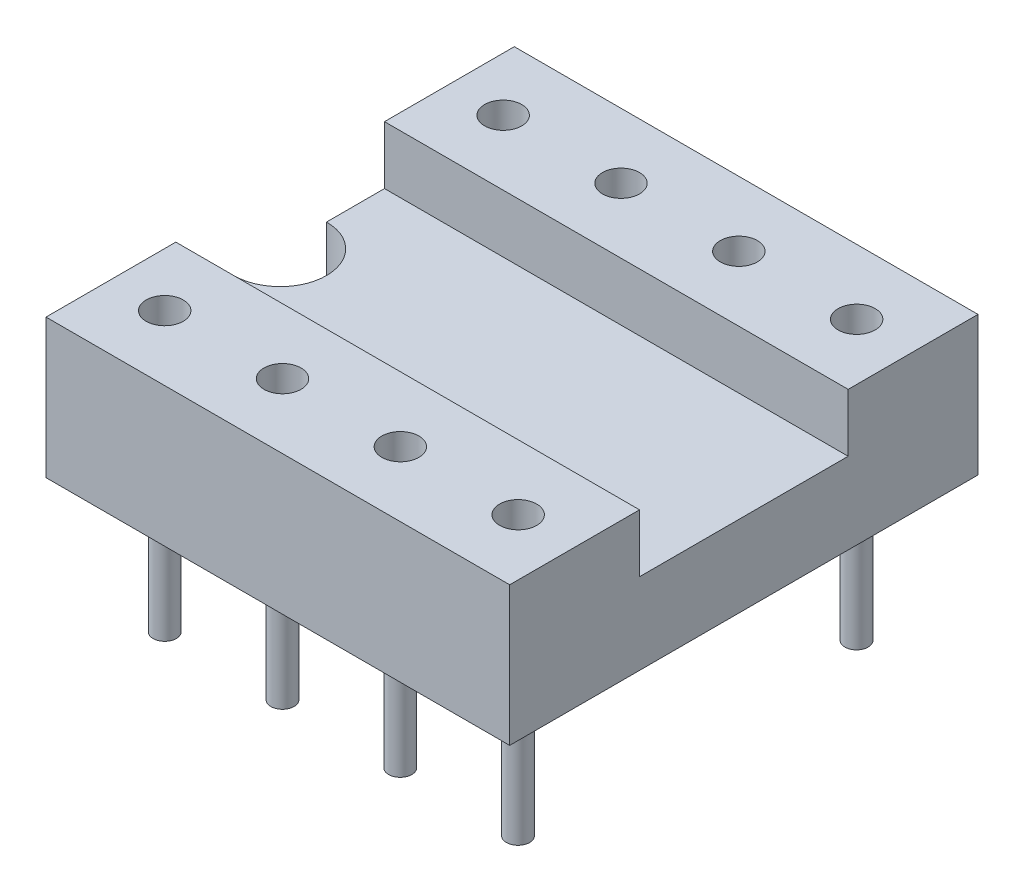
from build123d import *

# Parameters (mm, degrees)
EXTRUSION1_DEPTH        = 10
ENL_V_MAT_EXTRU_1_DEPTH = 12.338650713
ESQUISSE3_R             = 0.4
ENL_V_MAT_EXTRU_2_DEPTH = 2.5
ESQUISSE5_R             = 0.25
EXTRUSION2_DEPTH        = 3


with BuildPart() as part:
    # Esquisse1 → Extrusion1 (new body)
    with BuildSketch(Plane(origin=(0, 0, 0), x_dir=(0, 0, -1), z_dir=(1, 0, 0))):
        Polygon((-2.25, 1.75), (-2.25, 3), (-5.05, 3), (-5.05, 0), (5.05, 0), (5.05, 3), (2.25, 3), (2.25, 1.75), align=None)
    extrude(amount=EXTRUSION1_DEPTH)

    # Esquisse2 → Enl_v. mat.-Extru.1 (cut, through all)
    with BuildSketch(Plane(origin=(0, 1.75, 0), x_dir=(-1, 0, 0), z_dir=(0, 1, 0))):
        with BuildLine():
            Line((0, -1), (0, 1))
            ThreePointArc((0, 1), (-1, 0), (0, -1))
        make_face()
    extrude(amount=-ENL_V_MAT_EXTRU_1_DEPTH, mode=Mode.SUBTRACT)

    # Esquisse3 → Enl_v. mat.-Extru.2 (cut)
    with BuildSketch(Plane(origin=(0, 3, 0), x_dir=(-1, 0, 0), z_dir=(0, 1, 0))):
        with Locations(Location((-1.16, 3.65, 0), (0, 0, 90))):
            Circle(ESQUISSE3_R)
        with Locations(Location((-1.16, -3.65, 0), (0, 0, 270))):
            Circle(ESQUISSE3_R)
        with Locations(Location((-3.701, 3.65, 0), (0, 0, 90))):
            Circle(ESQUISSE3_R)
        with Locations(Location((-3.701, -3.65, 0), (0, 0, 270))):
            Circle(ESQUISSE3_R)
        with Locations(Location((-6.242, 3.65, 0), (0, 0, 90))):
            Circle(ESQUISSE3_R)
        with Locations(Location((-6.242, -3.65, 0), (0, 0, 270))):
            Circle(ESQUISSE3_R)
        with Locations(Location((-8.783, 3.65, 0), (0, 0, 90))):
            Circle(ESQUISSE3_R)
        with Locations(Location((-8.783, -3.65, 0), (0, 0, 270))):
            Circle(ESQUISSE3_R)
    extrude(amount=-ENL_V_MAT_EXTRU_2_DEPTH, mode=Mode.SUBTRACT)

    # Esquisse5 → Extrusion2 (add)
    with BuildSketch(Plane.XZ):
        with Locations(Location((1.16, 3.65, 0), (0, 0, 90))):
            Circle(ESQUISSE5_R)
        with Locations(Location((1.16, -3.65, 0), (0, 0, 90))):
            Circle(ESQUISSE5_R)
        with Locations(Location((3.7, -3.65, 0), (0, 0, 90))):
            Circle(ESQUISSE5_R)
        with Locations(Location((3.7, 3.65, 0), (0, 0, 90))):
            Circle(ESQUISSE5_R)
        with Locations(Location((6.24, -3.65, 0), (0, 0, 90))):
            Circle(ESQUISSE5_R)
        with Locations(Location((6.24, 3.65, 0), (0, 0, 90))):
            Circle(ESQUISSE5_R)
        with Locations(Location((8.78, -3.65, 0), (0, 0, 90))):
            Circle(ESQUISSE5_R)
        with Locations(Location((8.78, 3.65, 0), (0, 0, 90))):
            Circle(ESQUISSE5_R)
    extrude(amount=EXTRUSION2_DEPTH)


solid = part.part
